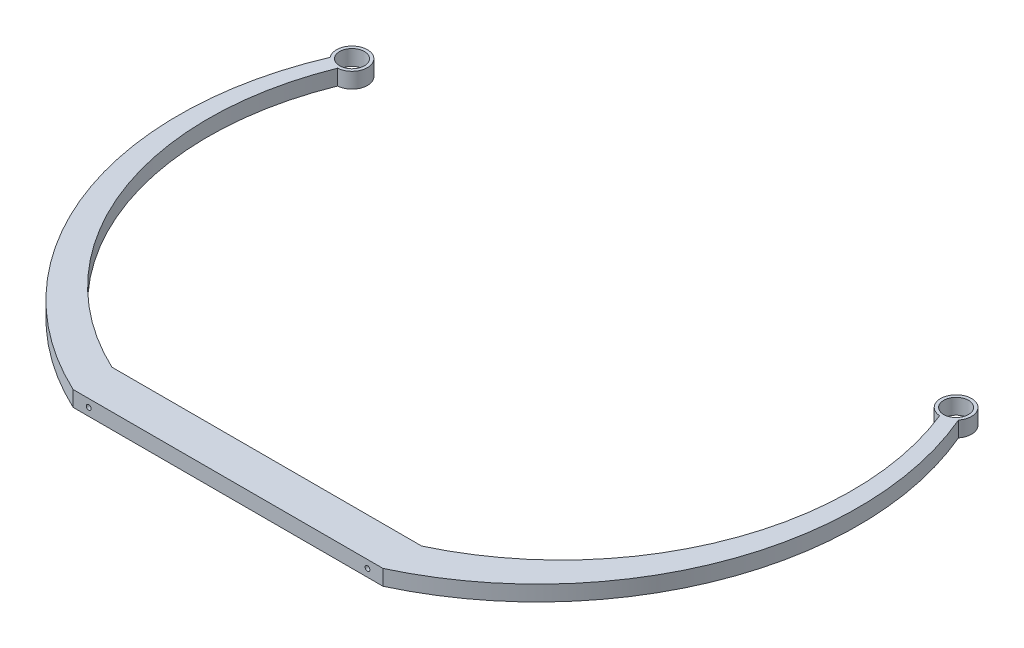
from build123d import *

# Parameters (mm, degrees)
EXTRUDE_1_DEPTH     = 10
SKETCH_2_R          = 8
CUT_EXTRUDE_1_DEPTH = 262.816339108
SKETCH_3_R          = 1.55
CUT_EXTRUDE_2_DEPTH = 341.355028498


with BuildPart() as part:
    # Sketch 1 → Extrude 1 (new body)
    with BuildSketch(Plane(origin=(0, 0, 0), x_dir=(1, 0, 0), z_dir=(0, 1, 0))):
        with BuildLine():
            ThreePointArc((-194.347397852, 122.521317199), (-194.859108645, -16.233486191), (-100, -117.5))
            Line((-100, -117.5), (100, -117.5))
            ThreePointArc((100, -117.5), (194.859108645, -16.233486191), (194.347397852, 122.521317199))
            ThreePointArc((194.347397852, 122.521317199), (190.973397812, 141.653495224), (202.796765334, 126.23817516))
            ThreePointArc((202.796765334, 126.23817516), (205.75582114, -28.923525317), (100, -142.5))
            Line((100, -142.5), (-100, -142.5))
            ThreePointArc((-100, -142.5), (-205.75582114, -28.923525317), (-202.796765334, 126.23817516))
            ThreePointArc((-202.796765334, 126.23817516), (-190.973397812, 141.653495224), (-194.347397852, 122.521317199))
        make_face()
    extrude(amount=EXTRUDE_1_DEPTH)

    # Sketch 2 → Cut-Extrude 1 (cut, through all)
    with BuildSketch(Plane(origin=(0, 10, 0), x_dir=(1, 0, 0), z_dir=(0, 1, 0))):
        with Locations(Location((-195, 132.5, 0), (0, 0, 270))):
            Circle(SKETCH_2_R)
        with Locations(Location((195, 132.5, 0), (0, 0, 270))):
            Circle(SKETCH_2_R)
    extrude(amount=-CUT_EXTRUDE_1_DEPTH, mode=Mode.SUBTRACT)

    # Sketch 3 → Cut-Extrude 2 (cut, through all)
    with BuildSketch(Plane(origin=(0, 0, 117.5), x_dir=(-1, 0, 0), z_dir=(0, 0, -1))):
        with Locations((-90, 5)):
            Circle(SKETCH_3_R)
        with Locations((90, 5)):
            Circle(SKETCH_3_R)
    extrude(amount=-CUT_EXTRUDE_2_DEPTH, mode=Mode.SUBTRACT)


solid = part.part
